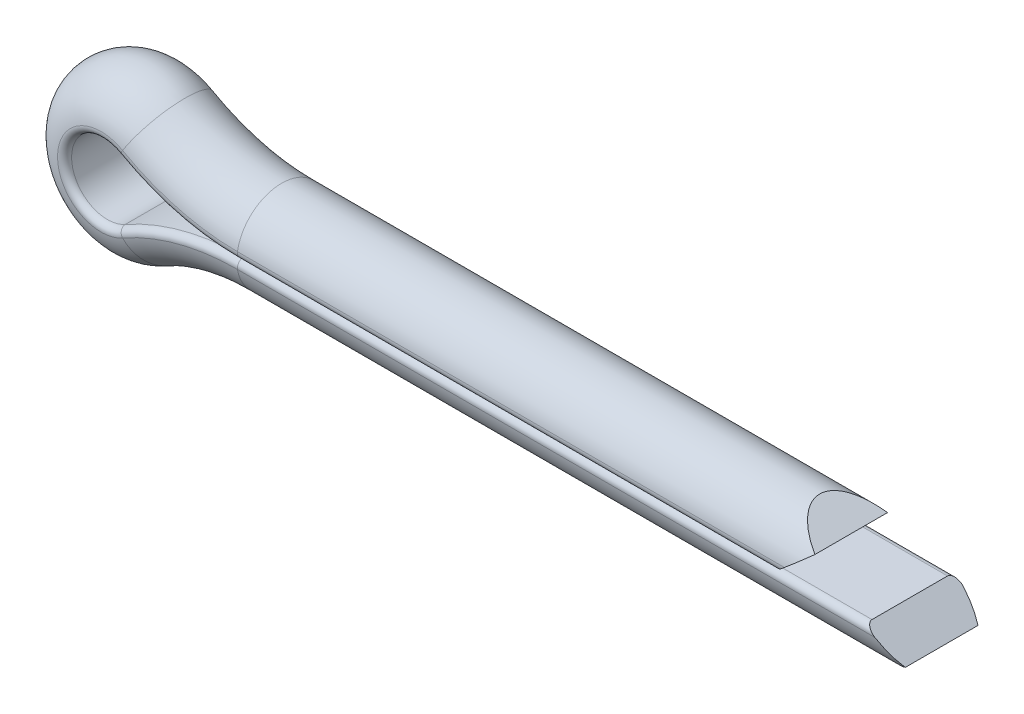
from build123d import *

# Parameters (mm, degrees)
CONECUT_DEPTH      = 29.146662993
CONECUT_DEPTH_BACK = 29.146662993


with BuildPart() as part:
    # BaseBody: sweep along a path in PathSke
    with BuildLine(Plane.XY) as basebody_path:
        Line((24.78536, 1.5748), (4.78536, 1.5748))
        ThreePointArc((4.78536, 1.5748), (3.032833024, 1.801628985), (1.395804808, 2.467166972))
        ThreePointArc((1.395804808, 2.467166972), (-2.83464, 0), (1.395804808, -2.467166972))
        ThreePointArc((1.395804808, -2.467166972), (3.032833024, -1.801628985), (4.78536, -1.5748))
        Line((4.78536, -1.5748), (27.96036, -1.5748))
    # SectionSke → BaseBody (sweep)
    with BuildSketch(Plane(origin=(24.78536, 1.5748, 0), x_dir=(0, 0, -1), z_dir=(1, 0, 0))):
        with BuildLine():
            Line((-1.326302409, -1.5728), (1.326302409, -1.5728))
            ThreePointArc((1.326302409, -1.5728), (1.501244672, -1.491350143), (1.551523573, -1.305041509))
            ThreePointArc((1.551523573, -1.305041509), (0, 0), (-1.551523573, -1.305041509))
            ThreePointArc((-1.551523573, -1.305041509), (-1.501244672, -1.491350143), (-1.326302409, -1.5728))
        make_face()
    sweep(path=basebody_path.line)

    # ConeCutSke → ConeCut (cut, two sides: drawn at the far end of the back side and taken through both)
    with BuildSketch(Plane.XY.offset(-CONECUT_DEPTH_BACK)):
        Polygon((23.663757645, 1.5848), (27.97036, 1.5848), (27.97036, -1.5848), (26.838757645, -1.5848), (27.96036, -0.922279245), (26.838757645, 0), (23.663757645, 0), (24.78536, 0.922279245), align=None)
    extrude(amount=CONECUT_DEPTH + CONECUT_DEPTH_BACK, mode=Mode.SUBTRACT)


solid = part.part
